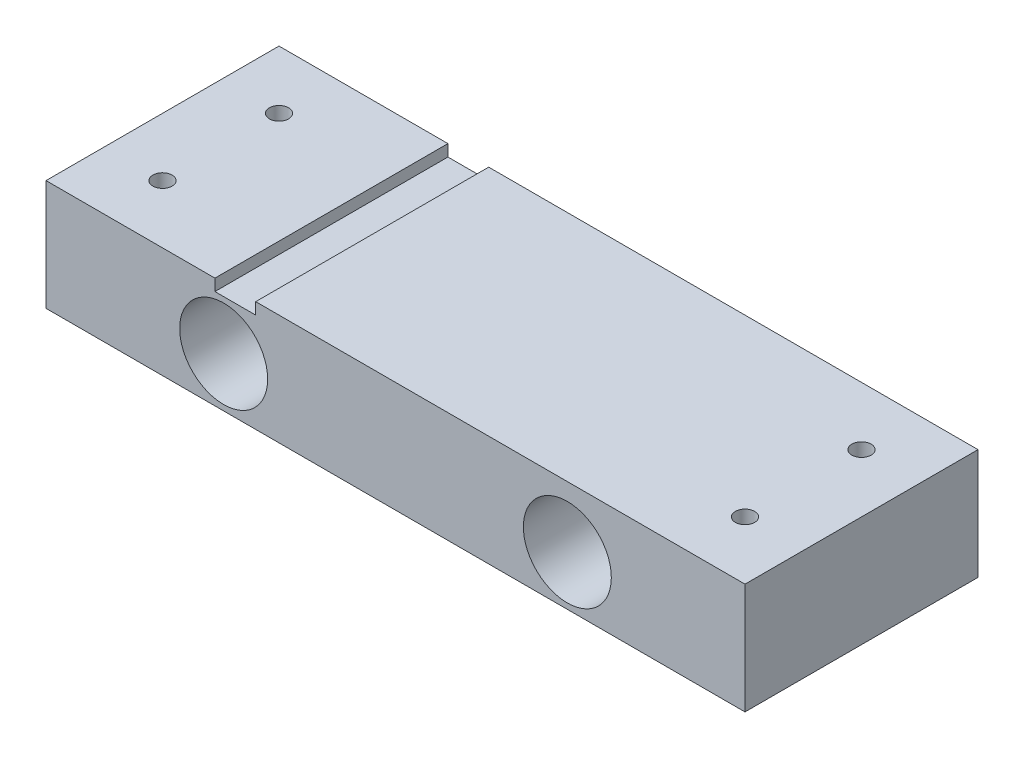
from build123d import *

# Parameters (mm, degrees)
CROQUIS1_R              = 7.55
SALIENTE_EXTRUIR1_DEPTH = 40
CROQUIS2_R              = 1.65
CORTAR_EXTRUIR1_DEPTH   = 5


with BuildPart() as part:
    # Croquis1 → Saliente-Extruir1 (new body)
    with BuildSketch(Plane.XY):
        Polygon((-60, -8), (60, -8), (60, 11), (-24, 11), (-24, 9), (-31, 9), (-31, 11), (-60, 11), align=None)
        with Locations((-29.5, 0.5)):
            Circle(CROQUIS1_R, mode=Mode.SUBTRACT)
        with Locations((29.5, 0.5)):
            Circle(CROQUIS1_R, mode=Mode.SUBTRACT)
    extrude(amount=SALIENTE_EXTRUIR1_DEPTH)

    # Croquis2 → Cortar-Extruir1 (cut)
    with BuildSketch(Plane(origin=(0, 11, 0), x_dir=(1, 0, 0), z_dir=(0, 1, 0))):
        with Locations(Location((-50, -10, 0), (0, 0, 180))):
            Circle(CROQUIS2_R)
        with Locations(Location((50, -10, 0), (0, 0, 180))):
            Circle(CROQUIS2_R)
        with Locations(Location((50, -30, 0), (0, 0, 180))):
            Circle(CROQUIS2_R)
        with Locations(Location((-50, -30, 0), (0, 0, 180))):
            Circle(CROQUIS2_R)
    extrude(amount=-CORTAR_EXTRUIR1_DEPTH, mode=Mode.SUBTRACT)


solid = part.part
